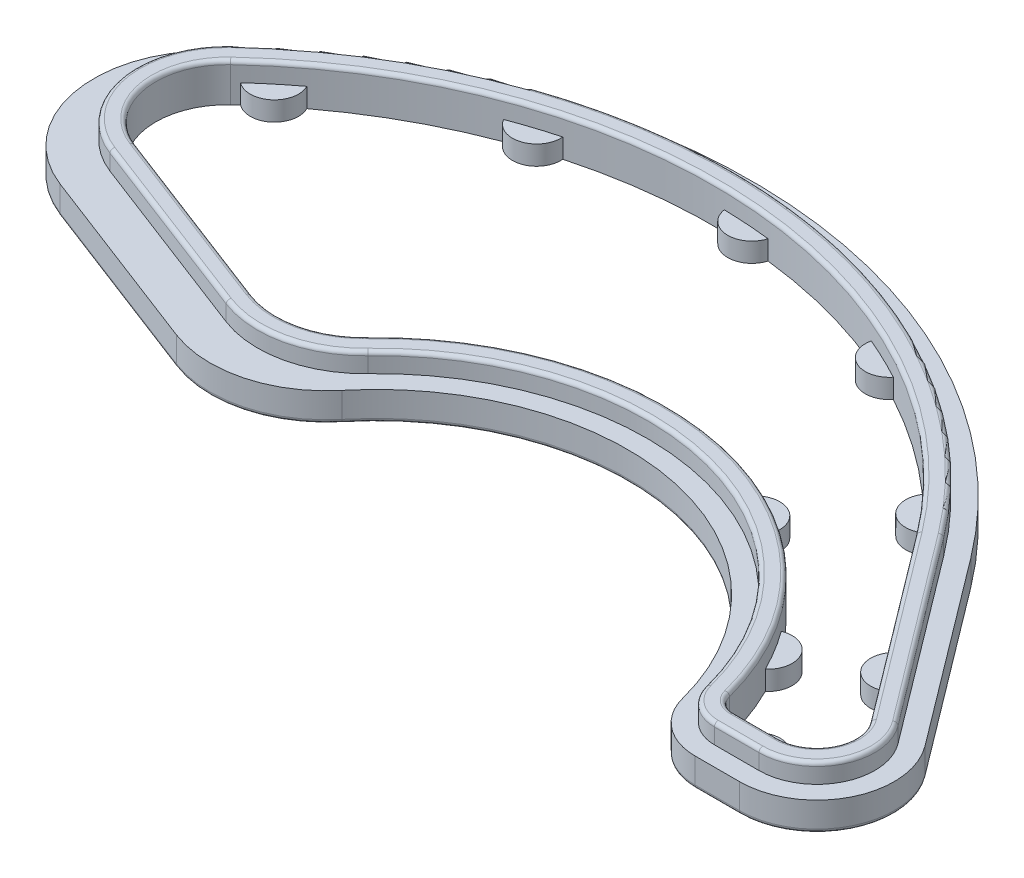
from build123d import *

# Parameters (mm, degrees)
ESTRUSIONE_ESTRUSIONE1_DEPTH = 1
TAGLIO_ESTRUSIONE2_DEPTH     = 36.898600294
SCHIZZO32_R                  = 1.25
ESTRUSIONE_ESTRUSIONE2_DEPTH = 1
ESTRUSIONE_ESTRUSIONE3_START = -0.5
ESTRUSIONE_ESTRUSIONE3_DEPTH = 0.5
ESTRUSIONE_ESTRUSIONE4_DEPTH = 2
RACCORDO1_R                  = 0.2
RACCORDO2_R                  = 0.2


with BuildPart() as part:
    # Schizzo30 → Estrusione-Estrusione1 (new body)
    with BuildSketch(Plane(origin=(0, 0, 0), x_dir=(1, 0, 0), z_dir=(0, 1, 0))):
        with BuildLine():
            Line((-17.802733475, 0.711832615), (-8.030360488, -3.039429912))
            ThreePointArc((-8.030360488, -3.039429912), (-4.347907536, -3.239001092), (-1.244315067, -1.24701661))
            ThreePointArc((-1.244315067, -1.24701661), (11.606068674, 3.193540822), (21.387195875, -6.25))
            ThreePointArc((21.387195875, -6.25), (22.454816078, -7.871708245), (24.291933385, -8.5))
            Line((24.291933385, -8.5), (26.59651946, -8.5))
            ThreePointArc((26.59651946, -8.5), (30.176256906, -6.284791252), (29.7910615, -2.092739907))
            Line((29.7910615, -2.092739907), (22.561453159, 7.501274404))
            ThreePointArc((22.561453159, 7.501274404), (2.042615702, 18.676057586), (-19.873431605, 10.57757994))
            ThreePointArc((-19.873431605, 10.57757994), (-21.524579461, 5.080843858), (-17.802733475, 0.711832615))
        make_face()
    extrude(amount=ESTRUSIONE_ESTRUSIONE1_DEPTH)

    # Schizzo31 → Taglio-Estrusione2 (cut, through all)
    with BuildSketch(Plane(origin=(0, 0, 0), x_dir=(1, 0, 0), z_dir=(0, 1, 0))):
        with BuildLine():
            Line((-16.727629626, 3.512573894), (-6.955256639, -0.238688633))
            ThreePointArc((-6.955256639, -0.238688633), (-4.333119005, -0.43011146), (-2.044266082, 0.863488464))
            ThreePointArc((-2.044266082, 0.863488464), (12.584057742, 5.014851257), (23.323687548, -5.75))
            ThreePointArc((23.323687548, -5.75), (23.679560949, -6.290569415), (24.291933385, -6.5))
            Line((24.291933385, -6.5), (26.59651946, -6.5))
            ThreePointArc((26.59651946, -6.5), (28.386388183, -5.392395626), (28.19379048, -3.296369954))
            Line((28.19379048, -3.296369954), (20.964182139, 6.297644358))
            ThreePointArc((20.964182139, 6.297644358), (2.269368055, 16.651720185), (-17.929557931, 9.672726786))
            ThreePointArc((-17.929557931, 9.672726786), (-19.034486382, 6.259807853), (-16.727629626, 3.512573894))
        make_face()
    extrude(amount=TAGLIO_ESTRUSIONE2_DEPTH, mode=Mode.SUBTRACT)

    # Schizzo32 → Estrusione-Estrusione2 (add)
    with BuildSketch(Plane(origin=(0, 0, 0), x_dir=(1, 0, 0), z_dir=(0, 1, 0))):
        with Locations((-1.026622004, 1.5)):
            Circle(SCHIZZO32_R)
        with Locations((6.67517635, 5.096151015)):
            Circle(SCHIZZO32_R)
        with Locations((15.08260416, 3.845088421)):
            Circle(SCHIZZO32_R)
        with Locations((21.403651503, -1.837724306)):
            Circle(SCHIZZO32_R)
        with Locations((25.7, -6.75)):
            Circle(SCHIZZO32_R)
        with Locations((25.7, 0.428411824)):
            Circle(SCHIZZO32_R)
        with Locations((19.5, 8.444358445)):
            Circle(SCHIZZO32_R)
        with Locations((11.461773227, 14.393048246)):
            Circle(SCHIZZO32_R)
        with Locations((1.791396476, 16.939381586)):
            Circle(SCHIZZO32_R)
        with Locations((-8.134074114, 15.720762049)):
            Circle(SCHIZZO32_R)
        with Locations((-16.901257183, 10.910720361)):
            Circle(SCHIZZO32_R)
    extrude(amount=ESTRUSIONE_ESTRUSIONE2_DEPTH)

    # Schizzo33 → Estrusione-Estrusione3 (add)
    with BuildSketch(Plane(origin=(0, 0, 0), x_dir=(1, 0, 0), z_dir=(0, 1, 0)).offset(ESTRUSIONE_ESTRUSIONE3_START)):
        with BuildLine():
            Line((24.291933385, -8.5), (26.59651946, -8.5))
            ThreePointArc((26.59651946, -8.5), (30.176256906, -6.284791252), (29.7910615, -2.092739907))
            Line((29.7910615, -2.092739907), (22.561453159, 7.501274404))
            ThreePointArc((22.561453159, 7.501274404), (2.042615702, 18.676057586), (-19.873431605, 10.57757994))
            ThreePointArc((-19.873431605, 10.57757994), (-21.524579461, 5.080843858), (-17.802733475, 0.711832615))
            Line((-17.802733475, 0.711832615), (-8.030360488, -3.039429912))
            ThreePointArc((-8.030360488, -3.039429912), (-4.347907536, -3.239001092), (-1.244315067, -1.24701661))
            ThreePointArc((-1.244315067, -1.24701661), (11.606068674, 3.193540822), (21.387195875, -6.25))
            ThreePointArc((21.387195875, -6.25), (22.454816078, -7.871708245), (24.291933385, -8.5))
        make_face()
        with BuildLine():
            Line((24.291933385, -7.5), (26.59651946, -7.5))
            ThreePointArc((26.59651946, -7.5), (29.281322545, -5.838593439), (28.99242599, -2.694554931))
            Line((28.99242599, -2.694554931), (21.762817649, 6.899459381))
            ThreePointArc((21.762817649, 6.899459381), (1.970310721, 17.678675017), (-19.169947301, 9.866869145))
            ThreePointArc((-19.169947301, 9.866869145), (-20.545903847, 5.286255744), (-17.444365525, 1.645413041))
            Line((-17.444365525, 1.645413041), (-7.671992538, -2.105849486))
            ThreePointArc((-7.671992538, -2.105849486), (-4.603281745, -2.272158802), (-2.016954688, -0.612171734))
            ThreePointArc((-2.016954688, -0.612171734), (11.82192011, 4.169967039), (22.355441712, -6))
            ThreePointArc((22.355441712, -6), (23.067188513, -7.08113883), (24.291933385, -7.5))
        make_face(mode=Mode.SUBTRACT)
    extrude(amount=ESTRUSIONE_ESTRUSIONE3_DEPTH)

    # Schizzo34 → Estrusione-Estrusione4 (add)
    with BuildSketch(Plane(origin=(0, 0, 0), x_dir=(1, 0, 0), z_dir=(0, 1, 0))):
        with BuildLine():
            Line((24.291933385, -7.5), (26.59651946, -7.5))
            ThreePointArc((26.59651946, -7.5), (29.281322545, -5.838593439), (28.99242599, -2.694554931))
            Line((28.99242599, -2.694554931), (21.762817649, 6.899459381))
            ThreePointArc((21.762817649, 6.899459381), (2.355820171, 17.647976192), (-18.612588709, 10.403116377))
            ThreePointArc((-18.612588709, 10.403116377), (-20.015978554, 6.06830559), (-17.085997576, 2.578993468))
            Line((-17.085997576, 2.578993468), (-7.313624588, -1.172269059))
            ThreePointArc((-7.313624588, -1.172269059), (-4.11413555, -1.405840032), (-1.32131501, 0.172589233))
            ThreePointArc((-1.32131501, 0.172589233), (12.331787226, 4.047194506), (22.355441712, -6))
            ThreePointArc((22.355441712, -6), (23.067188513, -7.08113883), (24.291933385, -7.5))
        make_face()
        with BuildLine():
            Line((24.291933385, -6.5), (26.59651946, -6.5))
            ThreePointArc((26.59651946, -6.5), (28.386388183, -5.392395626), (28.19379048, -3.296369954))
            Line((28.19379048, -3.296369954), (20.964182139, 6.297644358))
            ThreePointArc((20.964182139, 6.297644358), (2.269368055, 16.651720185), (-17.929557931, 9.672726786))
            ThreePointArc((-17.929557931, 9.672726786), (-19.034486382, 6.259807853), (-16.727629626, 3.512573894))
            Line((-16.727629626, 3.512573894), (-6.955256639, -0.238688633))
            ThreePointArc((-6.955256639, -0.238688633), (-4.333119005, -0.43011146), (-2.044266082, 0.863488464))
            ThreePointArc((-2.044266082, 0.863488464), (12.584057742, 5.014851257), (23.323687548, -5.75))
            ThreePointArc((23.323687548, -5.75), (23.679560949, -6.290569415), (24.291933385, -6.5))
        make_face(mode=Mode.SUBTRACT)
    extrude(amount=ESTRUSIONE_ESTRUSIONE4_DEPTH)

    # Raccordo1
    raccordo1_edges = [part.edges().sort_by_distance(p)[0] for p in [
        (-4.347907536, -0.5, 3.239001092),
        (-12.916546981, -0.5, 1.163798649),
        (-21.524579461, -0.5, -5.080843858),
        (2.042615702, -0.5, -18.676057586),
        (26.176257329, -0.5, -2.704267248),
        (30.176256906, -0.5, 6.284791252),
        (25.444226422, -0.5, 8.5),
        (22.454816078, -0.5, 7.871708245),
        (11.606068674, -0.5, -3.193540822),
        (-12.558179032, -0.5, 0.230218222),
        (-4.603281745, -0.5, 2.272158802),
        (11.82192011, -0.5, -4.169967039),
        (23.067188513, -0.5, 7.08113883),
        (25.444226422, -0.5, 7.5),
        (29.281322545, -0.5, 5.838593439),
        (25.377621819, -0.5, -2.102452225),
        (1.970310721, -0.5, -17.678675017),
        (-20.545903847, -0.5, -5.286255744),
    ]]
    fillet(raccordo1_edges, radius=RACCORDO1_R)

    # Raccordo2
    raccordo2_edges = [part.edges().sort_by_distance(p)[0] for p in [
        (12.584057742, 2, -5.014851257),
        (23.067188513, 2, 7.08113883),
        (25.444226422, 2, 7.5),
        (29.281322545, 2, 5.838593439),
        (25.377621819, 2, -2.102452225),
        (2.355820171, 2, -17.647976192),
        (-20.015978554, 2, -6.06830559),
        (-12.199811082, 2, -0.703362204),
        (-4.11413555, 2, 1.405840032),
        (12.331787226, 2, -4.047194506),
        (23.679560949, 2, 6.290569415),
        (25.444226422, 2, 6.5),
        (28.386388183, 2, 5.392395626),
        (24.578986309, 2, -1.500637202),
        (2.269368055, 2, -16.651720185),
        (-19.034486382, 2, -6.259807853),
        (-11.841443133, 2, -1.636942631),
        (-4.333119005, 2, 0.43011146),
    ]]
    fillet(raccordo2_edges, radius=RACCORDO2_R)


solid = part.part
